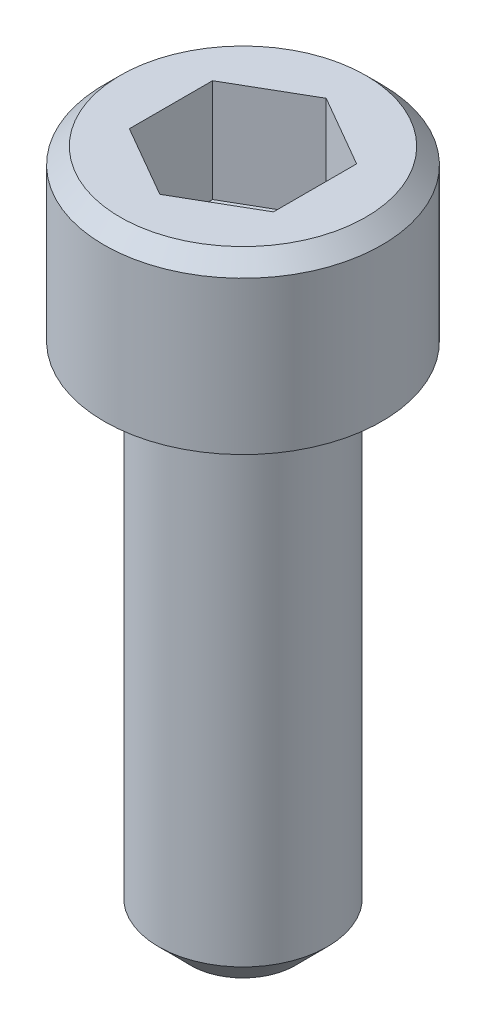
ISO-10303-21;
HEADER;
FILE_DESCRIPTION(('STEP AP214'),'2;1');
FILE_NAME('part.step','',(''),(''),'','','');
FILE_SCHEMA(('AUTOMOTIVE_DESIGN { 1 0 10303 214 1 1 1 1 }'));
ENDSEC;
DATA;
#1=APPLICATION_CONTEXT('core data for automotive mechanical design processes');
#2=APPLICATION_PROTOCOL_DEFINITION('international standard','automotive_design',2000,#1);
#3=PRODUCT_CONTEXT('',#1,'mechanical');
#4=PRODUCT('Part','Part','',(#3));
#5=PRODUCT_RELATED_PRODUCT_CATEGORY('part','',(#4));
#6=PRODUCT_DEFINITION_FORMATION('','',#4);
#7=PRODUCT_DEFINITION_CONTEXT('part definition',#1,'design');
#8=PRODUCT_DEFINITION('design','',#6,#7);
#9=PRODUCT_DEFINITION_SHAPE('','',#8);
#10=(LENGTH_UNIT() NAMED_UNIT(*) SI_UNIT(.MILLI.,.METRE.));
#11=(NAMED_UNIT(*) PLANE_ANGLE_UNIT() SI_UNIT($,.RADIAN.));
#12=(NAMED_UNIT(*) SI_UNIT($,.STERADIAN.) SOLID_ANGLE_UNIT());
#13=UNCERTAINTY_MEASURE_WITH_UNIT(LENGTH_MEASURE(1.E-05),#10,'distance_accuracy_value','');
#14=(GEOMETRIC_REPRESENTATION_CONTEXT(3) GLOBAL_UNCERTAINTY_ASSIGNED_CONTEXT((#13)) GLOBAL_UNIT_ASSIGNED_CONTEXT((#10,
#11,#12)) REPRESENTATION_CONTEXT('',''));
#15=CARTESIAN_POINT('',(0.,0.,0.));
#16=DIRECTION('',(0.,0.,1.));
#17=DIRECTION('',(1.,0.,0.));
#18=AXIS2_PLACEMENT_3D('',#15,#16,#17);
#19=CARTESIAN_POINT('',(0.,0.,2.22044604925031E-13));
#20=DIRECTION('',(0.,-1.,0.));
#21=DIRECTION('',(0.,0.,-1.));
#22=AXIS2_PLACEMENT_3D('',#19,#20,#21);
#23=PLANE('',#22);
#24=CARTESIAN_POINT('',(0.,0.,2.22044604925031E-13));
#25=DIRECTION('',(0.,-1.,0.));
#26=DIRECTION('',(0.,0.,-1.));
#27=AXIS2_PLACEMENT_3D('',#24,#25,#26);
#28=CIRCLE('',#27,2.0828);
#29=CARTESIAN_POINT('',(0.,0.,-2.08279999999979));
#30=VERTEX_POINT('',#29);
#31=EDGE_CURVE('E148',#30,#30,#28,.T.);
#32=ORIENTED_EDGE('',*,*,#31,.F.);
#33=EDGE_LOOP('',(#32));
#34=FACE_BOUND('',#33,.T.);
#35=CARTESIAN_POINT('',(0.,0.,2.22044604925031E-13));
#36=DIRECTION('',(0.,-1.,0.));
#37=DIRECTION('',(0.,0.,-1.));
#38=AXIS2_PLACEMENT_3D('',#35,#36,#37);
#39=CIRCLE('',#38,3.429);
#40=CARTESIAN_POINT('',(0.,0.,-3.42899999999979));
#41=VERTEX_POINT('',#40);
#42=EDGE_CURVE('E11',#41,#41,#39,.T.);
#43=ORIENTED_EDGE('',*,*,#42,.T.);
#44=EDGE_LOOP('',(#43));
#45=FACE_BOUND('',#44,.T.);
#46=ADVANCED_FACE('F34',(#34,#45),#23,.T.);
#47=CARTESIAN_POINT('',(0.,0.,2.22044604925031E-13));
#48=DIRECTION('',(0.,-1.,0.));
#49=DIRECTION('',(0.,0.,-1.));
#50=AXIS2_PLACEMENT_3D('',#47,#48,#49);
#51=CYLINDRICAL_SURFACE('',#50,3.429);
#52=CARTESIAN_POINT('',(0.,3.76872500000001,1.99840144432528E-12));
#53=DIRECTION('',(0.,-1.,0.));
#54=DIRECTION('',(0.,0.,-1.));
#55=AXIS2_PLACEMENT_3D('',#52,#53,#54);
#56=CIRCLE('',#55,3.429);
#57=CARTESIAN_POINT('',(0.,3.76872500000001,-3.42899999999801));
#58=VERTEX_POINT('',#57);
#59=EDGE_CURVE('E41',#58,#58,#56,.T.);
#60=ORIENTED_EDGE('',*,*,#59,.T.);
#61=EDGE_LOOP('',(#60));
#62=FACE_BOUND('',#61,.T.);
#63=ORIENTED_EDGE('',*,*,#42,.F.);
#64=EDGE_LOOP('',(#63));
#65=FACE_BOUND('',#64,.T.);
#66=ADVANCED_FACE('F156',(#62,#65),#51,.T.);
#67=CARTESIAN_POINT('',(0.,3.76872500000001,1.99840144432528E-12));
#68=DIRECTION('',(0.,-1.,0.));
#69=DIRECTION('',(0.,0.,-1.));
#70=AXIS2_PLACEMENT_3D('',#67,#68,#69);
#71=CONICAL_SURFACE('',#70,3.429,0.78539816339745);
#72=CARTESIAN_POINT('',(0.,4.16559999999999,-4.44089209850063E-13));
#73=DIRECTION('',(0.,-1.,0.));
#74=DIRECTION('',(0.,0.,-1.));
#75=AXIS2_PLACEMENT_3D('',#72,#73,#74);
#76=CIRCLE('',#75,3.032125);
#77=CARTESIAN_POINT('',(0.,4.16559999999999,-3.03212500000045));
#78=VERTEX_POINT('',#77);
#79=EDGE_CURVE('E151',#78,#78,#76,.T.);
#80=ORIENTED_EDGE('',*,*,#79,.T.);
#81=EDGE_LOOP('',(#80));
#82=FACE_BOUND('',#81,.T.);
#83=ORIENTED_EDGE('',*,*,#59,.F.);
#84=EDGE_LOOP('',(#83));
#85=FACE_BOUND('',#84,.T.);
#86=ADVANCED_FACE('F159',(#82,#85),#71,.T.);
#87=CARTESIAN_POINT('',(3.03212499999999,4.16559999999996,-4.44089209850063E-13));
#88=DIRECTION('',(0.,1.,0.));
#89=DIRECTION('',(0.,0.,1.));
#90=AXIS2_PLACEMENT_3D('',#87,#88,#89);
#91=PLANE('',#90);
#92=DIRECTION('',(0.,0.,1.));
#93=VECTOR('',#92,1.);
#94=CARTESIAN_POINT('',(-1.77799999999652,4.16560000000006,-1.02652877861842));
#95=LINE('',#94,#93);
#96=CARTESIAN_POINT('',(-1.77799999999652,4.16560000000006,-1.02652877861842));
#97=VERTEX_POINT('',#96);
#98=CARTESIAN_POINT('',(-1.7779999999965,4.16560000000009,1.02652877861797));
#99=VERTEX_POINT('',#98);
#100=EDGE_CURVE('E48',#97,#99,#95,.T.);
#101=ORIENTED_EDGE('',*,*,#100,.F.);
#102=DIRECTION('',(-0.86602540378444,0.,0.500000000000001));
#103=VECTOR('',#102,1.);
#104=CARTESIAN_POINT('',(3.49720252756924E-12,4.16559999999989,-2.05305755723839));
#105=LINE('',#104,#103);
#106=CARTESIAN_POINT('',(3.49720252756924E-12,4.16559999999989,-2.05305755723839));
#107=VERTEX_POINT('',#106);
#108=EDGE_CURVE('E118',#107,#97,#105,.T.);
#109=ORIENTED_EDGE('',*,*,#108,.F.);
#110=DIRECTION('',(-0.866025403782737,0.,-0.500000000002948));
#111=VECTOR('',#110,1.);
#112=CARTESIAN_POINT('',(1.778,4.1656000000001,-1.02652877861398));
#113=LINE('',#112,#111);
#114=CARTESIAN_POINT('',(1.778,4.1656000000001,-1.02652877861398));
#115=VERTEX_POINT('',#114);
#116=EDGE_CURVE('E112',#115,#107,#113,.T.);
#117=ORIENTED_EDGE('',*,*,#116,.F.);
#118=DIRECTION('',(0.,0.,-1.));
#119=VECTOR('',#118,1.);
#120=CARTESIAN_POINT('',(1.778,4.16559999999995,1.02652877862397));
#121=LINE('',#120,#119);
#122=CARTESIAN_POINT('',(1.778,4.16559999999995,1.02652877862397));
#123=VERTEX_POINT('',#122);
#124=EDGE_CURVE('E110',#123,#115,#121,.T.);
#125=ORIENTED_EDGE('',*,*,#124,.F.);
#126=DIRECTION('',(0.866025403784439,0.,-0.500000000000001));
#127=VECTOR('',#126,1.);
#128=CARTESIAN_POINT('',(0.,4.16560000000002,2.05305755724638));
#129=LINE('',#128,#127);
#130=CARTESIAN_POINT('',(0.,4.16560000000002,2.05305755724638));
#131=VERTEX_POINT('',#130);
#132=EDGE_CURVE('E91',#131,#123,#129,.T.);
#133=ORIENTED_EDGE('',*,*,#132,.F.);
#134=DIRECTION('',(0.866025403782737,0.,0.500000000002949));
#135=VECTOR('',#134,1.);
#136=CARTESIAN_POINT('',(-1.7779999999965,4.16560000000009,1.02652877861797));
#137=LINE('',#136,#135);
#138=EDGE_CURVE('E102',#99,#131,#137,.T.);
#139=ORIENTED_EDGE('',*,*,#138,.F.);
#140=EDGE_LOOP('',(#101,#109,#117,#125,#133,#139));
#141=FACE_BOUND('',#140,.T.);
#142=ORIENTED_EDGE('',*,*,#79,.F.);
#143=EDGE_LOOP('',(#142));
#144=FACE_BOUND('',#143,.T.);
#145=ADVANCED_FACE('F106',(#141,#144),#91,.T.);
#146=CARTESIAN_POINT('',(0.,0.,2.22044604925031E-13));
#147=DIRECTION('',(0.,-1.,0.));
#148=DIRECTION('',(0.,0.,-1.));
#149=AXIS2_PLACEMENT_3D('',#146,#147,#148);
#150=CYLINDRICAL_SURFACE('',#149,2.0828);
#151=ORIENTED_EDGE('',*,*,#31,.T.);
#152=EDGE_LOOP('',(#151));
#153=FACE_BOUND('',#152,.T.);
#154=CARTESIAN_POINT('',(0.,-11.9043591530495,8.88178419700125E-13));
#155=DIRECTION('',(0.,-1.,0.));
#156=DIRECTION('',(0.,0.,-1.));
#157=AXIS2_PLACEMENT_3D('',#154,#155,#156);
#158=CIRCLE('',#157,2.0828);
#159=CARTESIAN_POINT('',(0.,-11.9043591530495,-2.08279999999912));
#160=VERTEX_POINT('',#159);
#161=EDGE_CURVE('E145',#160,#160,#158,.T.);
#162=ORIENTED_EDGE('',*,*,#161,.F.);
#163=EDGE_LOOP('',(#162));
#164=FACE_BOUND('',#163,.T.);
#165=ADVANCED_FACE('F167',(#153,#164),#150,.T.);
#166=CARTESIAN_POINT('',(0.,-12.7000000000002,4.44089209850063E-13));
#167=DIRECTION('',(0.,1.,0.));
#168=DIRECTION('',(0.,0.,1.));
#169=AXIS2_PLACEMENT_3D('',#166,#167,#168);
#170=CONICAL_SURFACE('',#169,1.29053997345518,0.783269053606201);
#171=ORIENTED_EDGE('',*,*,#161,.T.);
#172=EDGE_LOOP('',(#171));
#173=FACE_BOUND('',#172,.T.);
#174=CARTESIAN_POINT('',(0.,-12.7000000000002,4.44089209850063E-13));
#175=DIRECTION('',(0.,-1.,0.));
#176=DIRECTION('',(0.,0.,-1.));
#177=AXIS2_PLACEMENT_3D('',#174,#175,#176);
#178=CIRCLE('',#177,1.29053997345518);
#179=CARTESIAN_POINT('',(0.,-12.7000000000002,-1.29053997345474));
#180=VERTEX_POINT('',#179);
#181=EDGE_CURVE('E136',#180,#180,#178,.T.);
#182=ORIENTED_EDGE('',*,*,#181,.F.);
#183=EDGE_LOOP('',(#182));
#184=FACE_BOUND('',#183,.T.);
#185=ADVANCED_FACE('F179',(#173,#184),#170,.T.);
#186=CARTESIAN_POINT('',(0.,-12.7000000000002,4.44089209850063E-13));
#187=DIRECTION('',(0.,-1.,0.));
#188=DIRECTION('',(0.,0.,-1.));
#189=AXIS2_PLACEMENT_3D('',#186,#187,#188);
#190=PLANE('',#189);
#191=ORIENTED_EDGE('',*,*,#181,.T.);
#192=EDGE_LOOP('',(#191));
#193=FACE_BOUND('',#192,.T.);
#194=ADVANCED_FACE('F185',(#193),#190,.T.);
#195=CARTESIAN_POINT('',(-1.77799999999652,1.62560000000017,-1.02652877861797));
#196=DIRECTION('',(-1.,0.,0.));
#197=DIRECTION('',(0.,0.,1.));
#198=AXIS2_PLACEMENT_3D('',#195,#196,#197);
#199=PLANE('',#198);
#200=ORIENTED_EDGE('',*,*,#100,.T.);
#201=DIRECTION('',(0.,1.,0.));
#202=VECTOR('',#201,1.);
#203=CARTESIAN_POINT('',(-1.77799999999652,1.62560000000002,1.02652877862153));
#204=LINE('',#203,#202);
#205=CARTESIAN_POINT('',(-1.77799999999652,1.62560000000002,1.02652877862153));
#206=VERTEX_POINT('',#205);
#207=EDGE_CURVE('E99',#206,#99,#204,.T.);
#208=ORIENTED_EDGE('',*,*,#207,.F.);
#209=DIRECTION('',(0.,0.,1.));
#210=VECTOR('',#209,1.);
#211=CARTESIAN_POINT('',(-1.77799999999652,1.62560000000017,-1.02652877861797));
#212=LINE('',#211,#210);
#213=CARTESIAN_POINT('',(-1.77799999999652,1.62560000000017,-1.02652877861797));
#214=VERTEX_POINT('',#213);
#215=EDGE_CURVE('E120',#214,#206,#212,.T.);
#216=ORIENTED_EDGE('',*,*,#215,.F.);
#217=DIRECTION('',(0.,1.,0.));
#218=VECTOR('',#217,1.);
#219=CARTESIAN_POINT('',(-1.77799999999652,1.62560000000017,-1.02652877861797));
#220=LINE('',#219,#218);
#221=EDGE_CURVE('E55',#214,#97,#220,.T.);
#222=ORIENTED_EDGE('',*,*,#221,.T.);
#223=EDGE_LOOP('',(#200,#208,#216,#222));
#224=FACE_BOUND('',#223,.T.);
#225=ADVANCED_FACE('F190',(#224),#199,.F.);
#226=CARTESIAN_POINT('',(3.49199835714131E-12,1.62559999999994,-2.05305755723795));
#227=DIRECTION('',(-0.5,0.,-0.866025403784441));
#228=DIRECTION('',(-0.86602540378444,0.,0.500000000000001));
#229=AXIS2_PLACEMENT_3D('',#226,#227,#228);
#230=PLANE('',#229);
#231=ORIENTED_EDGE('',*,*,#108,.T.);
#232=ORIENTED_EDGE('',*,*,#221,.F.);
#233=DIRECTION('',(-0.86602540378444,0.,0.500000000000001));
#234=VECTOR('',#233,1.);
#235=CARTESIAN_POINT('',(3.49199835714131E-12,1.62559999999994,-2.05305755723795));
#236=LINE('',#235,#234);
#237=CARTESIAN_POINT('',(3.49199835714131E-12,1.62559999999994,-2.05305755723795));
#238=VERTEX_POINT('',#237);
#239=EDGE_CURVE('E132',#238,#214,#236,.T.);
#240=ORIENTED_EDGE('',*,*,#239,.F.);
#241=DIRECTION('',(0.,1.,0.));
#242=VECTOR('',#241,1.);
#243=CARTESIAN_POINT('',(3.49199835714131E-12,1.62559999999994,-2.05305755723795));
#244=LINE('',#243,#242);
#245=EDGE_CURVE('E137',#238,#107,#244,.T.);
#246=ORIENTED_EDGE('',*,*,#245,.T.);
#247=EDGE_LOOP('',(#231,#232,#240,#246));
#248=FACE_BOUND('',#247,.T.);
#249=ADVANCED_FACE('F195',(#248),#230,.F.);
#250=CARTESIAN_POINT('',(1.778,1.62559999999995,-1.0265287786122));
#251=DIRECTION('',(0.500000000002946,0.,-0.866025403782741));
#252=DIRECTION('',(-0.866025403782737,0.,-0.500000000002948));
#253=AXIS2_PLACEMENT_3D('',#250,#251,#252);
#254=PLANE('',#253);
#255=ORIENTED_EDGE('',*,*,#116,.T.);
#256=ORIENTED_EDGE('',*,*,#245,.F.);
#257=DIRECTION('',(-0.866025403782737,0.,-0.500000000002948));
#258=VECTOR('',#257,1.);
#259=CARTESIAN_POINT('',(1.778,1.62559999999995,-1.0265287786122));
#260=LINE('',#259,#258);
#261=CARTESIAN_POINT('',(1.778,1.62559999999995,-1.0265287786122));
#262=VERTEX_POINT('',#261);
#263=EDGE_CURVE('E129',#262,#238,#260,.T.);
#264=ORIENTED_EDGE('',*,*,#263,.F.);
#265=DIRECTION('',(0.,1.,0.));
#266=VECTOR('',#265,1.);
#267=CARTESIAN_POINT('',(1.778,1.62559999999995,-1.0265287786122));
#268=LINE('',#267,#266);
#269=EDGE_CURVE('E139',#262,#115,#268,.T.);
#270=ORIENTED_EDGE('',*,*,#269,.T.);
#271=EDGE_LOOP('',(#255,#256,#264,#270));
#272=FACE_BOUND('',#271,.T.);
#273=ADVANCED_FACE('F206',(#272),#254,.F.);
#274=CARTESIAN_POINT('',(1.778,1.62559999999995,1.02652877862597));
#275=DIRECTION('',(1.,0.,0.));
#276=DIRECTION('',(0.,0.,-1.));
#277=AXIS2_PLACEMENT_3D('',#274,#275,#276);
#278=PLANE('',#277);
#279=ORIENTED_EDGE('',*,*,#124,.T.);
#280=ORIENTED_EDGE('',*,*,#269,.F.);
#281=DIRECTION('',(0.,0.,-1.));
#282=VECTOR('',#281,1.);
#283=CARTESIAN_POINT('',(1.778,1.62559999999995,1.02652877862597));
#284=LINE('',#283,#282);
#285=CARTESIAN_POINT('',(1.778,1.62559999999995,1.02652877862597));
#286=VERTEX_POINT('',#285);
#287=EDGE_CURVE('E126',#286,#262,#284,.T.);
#288=ORIENTED_EDGE('',*,*,#287,.F.);
#289=DIRECTION('',(0.,1.,0.));
#290=VECTOR('',#289,1.);
#291=CARTESIAN_POINT('',(1.778,1.62559999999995,1.02652877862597));
#292=LINE('',#291,#290);
#293=EDGE_CURVE('E98',#286,#123,#292,.T.);
#294=ORIENTED_EDGE('',*,*,#293,.T.);
#295=EDGE_LOOP('',(#279,#280,#288,#294));
#296=FACE_BOUND('',#295,.T.);
#297=ADVANCED_FACE('F203',(#296),#278,.F.);
#298=CARTESIAN_POINT('',(0.,1.62559999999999,2.05305755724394));
#299=DIRECTION('',(0.5,0.,0.866025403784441));
#300=DIRECTION('',(0.866025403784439,0.,-0.500000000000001));
#301=AXIS2_PLACEMENT_3D('',#298,#299,#300);
#302=PLANE('',#301);
#303=ORIENTED_EDGE('',*,*,#132,.T.);
#304=ORIENTED_EDGE('',*,*,#293,.F.);
#305=DIRECTION('',(0.866025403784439,0.,-0.500000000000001));
#306=VECTOR('',#305,1.);
#307=CARTESIAN_POINT('',(0.,1.62559999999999,2.05305755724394));
#308=LINE('',#307,#306);
#309=CARTESIAN_POINT('',(0.,1.62559999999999,2.05305755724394));
#310=VERTEX_POINT('',#309);
#311=EDGE_CURVE('E94',#310,#286,#308,.T.);
#312=ORIENTED_EDGE('',*,*,#311,.F.);
#313=DIRECTION('',(0.,1.,0.));
#314=VECTOR('',#313,1.);
#315=CARTESIAN_POINT('',(0.,1.62559999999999,2.05305755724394));
#316=LINE('',#315,#314);
#317=EDGE_CURVE('E87',#310,#131,#316,.T.);
#318=ORIENTED_EDGE('',*,*,#317,.T.);
#319=EDGE_LOOP('',(#303,#304,#312,#318));
#320=FACE_BOUND('',#319,.T.);
#321=ADVANCED_FACE('F89',(#320),#302,.F.);
#322=CARTESIAN_POINT('',(-1.77799999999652,1.62560000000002,1.02652877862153));
#323=DIRECTION('',(-0.500000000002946,0.,0.866025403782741));
#324=DIRECTION('',(0.866025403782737,0.,0.500000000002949));
#325=AXIS2_PLACEMENT_3D('',#322,#323,#324);
#326=PLANE('',#325);
#327=ORIENTED_EDGE('',*,*,#138,.T.);
#328=ORIENTED_EDGE('',*,*,#317,.F.);
#329=DIRECTION('',(0.866025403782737,0.,0.500000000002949));
#330=VECTOR('',#329,1.);
#331=CARTESIAN_POINT('',(-1.77799999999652,1.62560000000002,1.02652877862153));
#332=LINE('',#331,#330);
#333=EDGE_CURVE('E123',#206,#310,#332,.T.);
#334=ORIENTED_EDGE('',*,*,#333,.F.);
#335=ORIENTED_EDGE('',*,*,#207,.T.);
#336=EDGE_LOOP('',(#327,#328,#334,#335));
#337=FACE_BOUND('',#336,.T.);
#338=ADVANCED_FACE('F103',(#337),#326,.F.);
#339=CARTESIAN_POINT('',(-1.77799999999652,1.62560000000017,-1.02652877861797));
#340=DIRECTION('',(0.,-1.,0.));
#341=DIRECTION('',(0.,0.,-1.));
#342=AXIS2_PLACEMENT_3D('',#339,#340,#341);
#343=PLANE('',#342);
#344=ORIENTED_EDGE('',*,*,#215,.T.);
#345=ORIENTED_EDGE('',*,*,#333,.T.);
#346=ORIENTED_EDGE('',*,*,#311,.T.);
#347=ORIENTED_EDGE('',*,*,#287,.T.);
#348=ORIENTED_EDGE('',*,*,#263,.T.);
#349=ORIENTED_EDGE('',*,*,#239,.T.);
#350=EDGE_LOOP('',(#344,#345,#346,#347,#348,#349));
#351=FACE_BOUND('',#350,.T.);
#352=ADVANCED_FACE('F200',(#351),#343,.F.);
#353=CLOSED_SHELL('',(#46,#66,#86,#145,#165,#185,#194,#225,#249,#273,#297,#321,#338,#352));
#354=MANIFOLD_SOLID_BREP('B2',#353);
#355=ADVANCED_BREP_SHAPE_REPRESENTATION('',(#18,#354),#14);
#356=SHAPE_DEFINITION_REPRESENTATION(#9,#355);
ENDSEC;
END-ISO-10303-21;
